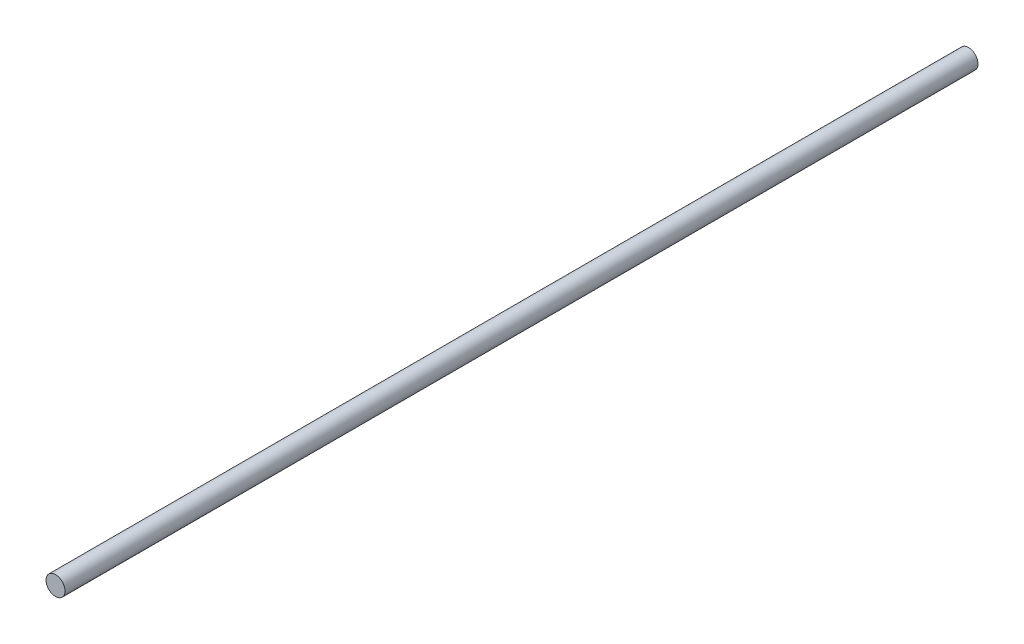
from build123d import *

# Parameters (mm, degrees)
SKETCH1_R      = 3.175
EXTRUDE1_DEPTH = 304.8


with BuildPart() as part:
    # Sketch1 → Extrude1 (new body)
    with BuildSketch(Plane.XY):
        with Locations(Location((0, 0, 0), (0, 0, 180))):
            Circle(SKETCH1_R)
    extrude(amount=EXTRUDE1_DEPTH)


solid = part.part
